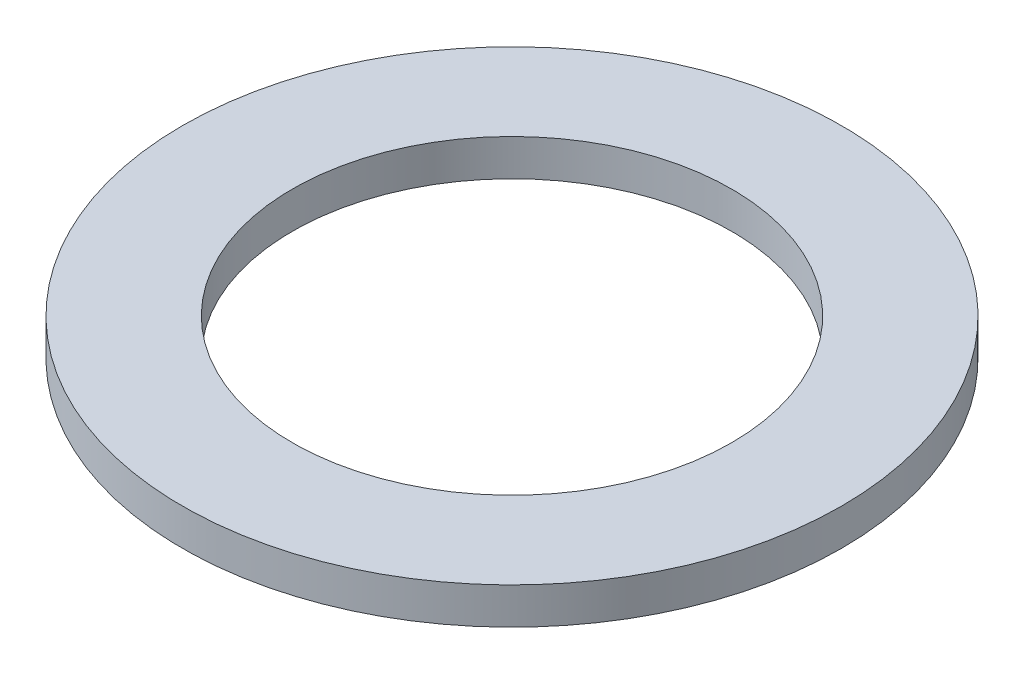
ISO-10303-21;
HEADER;
FILE_DESCRIPTION(('STEP AP214'),'2;1');
FILE_NAME('part.step','',(''),(''),'','','');
FILE_SCHEMA(('AUTOMOTIVE_DESIGN { 1 0 10303 214 1 1 1 1 }'));
ENDSEC;
DATA;
#1=APPLICATION_CONTEXT('core data for automotive mechanical design processes');
#2=APPLICATION_PROTOCOL_DEFINITION('international standard','automotive_design',2000,#1);
#3=PRODUCT_CONTEXT('',#1,'mechanical');
#4=PRODUCT('Part','Part','',(#3));
#5=PRODUCT_RELATED_PRODUCT_CATEGORY('part','',(#4));
#6=PRODUCT_DEFINITION_FORMATION('','',#4);
#7=PRODUCT_DEFINITION_CONTEXT('part definition',#1,'design');
#8=PRODUCT_DEFINITION('design','',#6,#7);
#9=PRODUCT_DEFINITION_SHAPE('','',#8);
#10=(LENGTH_UNIT() NAMED_UNIT(*) SI_UNIT(.MILLI.,.METRE.));
#11=(NAMED_UNIT(*) PLANE_ANGLE_UNIT() SI_UNIT($,.RADIAN.));
#12=(NAMED_UNIT(*) SI_UNIT($,.STERADIAN.) SOLID_ANGLE_UNIT());
#13=UNCERTAINTY_MEASURE_WITH_UNIT(LENGTH_MEASURE(1.E-05),#10,'distance_accuracy_value','');
#14=(GEOMETRIC_REPRESENTATION_CONTEXT(3) GLOBAL_UNCERTAINTY_ASSIGNED_CONTEXT((#13)) GLOBAL_UNIT_ASSIGNED_CONTEXT((#10,
#11,#12)) REPRESENTATION_CONTEXT('',''));
#15=CARTESIAN_POINT('',(0.,0.,0.));
#16=DIRECTION('',(0.,0.,1.));
#17=DIRECTION('',(1.,0.,0.));
#18=AXIS2_PLACEMENT_3D('',#15,#16,#17);
#19=CARTESIAN_POINT('',(0.,1.,0.));
#20=DIRECTION('',(0.,-1.,0.));
#21=DIRECTION('',(1.,0.,0.));
#22=AXIS2_PLACEMENT_3D('',#19,#20,#21);
#23=PLANE('',#22);
#24=CARTESIAN_POINT('',(0.,1.,0.));
#25=DIRECTION('',(0.,-1.,0.));
#26=DIRECTION('',(1.,0.,0.));
#27=AXIS2_PLACEMENT_3D('',#24,#25,#26);
#28=CIRCLE('',#27,9.);
#29=CARTESIAN_POINT('',(9.,1.,0.));
#30=VERTEX_POINT('',#29);
#31=EDGE_CURVE('E26',#30,#30,#28,.T.);
#32=ORIENTED_EDGE('',*,*,#31,.F.);
#33=EDGE_LOOP('',(#32));
#34=FACE_BOUND('',#33,.T.);
#35=CARTESIAN_POINT('',(0.,1.,0.));
#36=DIRECTION('',(0.,-1.,0.));
#37=DIRECTION('',(1.,0.,0.));
#38=AXIS2_PLACEMENT_3D('',#35,#36,#37);
#39=CIRCLE('',#38,6.);
#40=CARTESIAN_POINT('',(6.,1.,0.));
#41=VERTEX_POINT('',#40);
#42=EDGE_CURVE('E17',#41,#41,#39,.T.);
#43=ORIENTED_EDGE('',*,*,#42,.T.);
#44=EDGE_LOOP('',(#43));
#45=FACE_BOUND('',#44,.T.);
#46=ADVANCED_FACE('F14',(#34,#45),#23,.F.);
#47=CARTESIAN_POINT('',(0.,1.05,0.));
#48=DIRECTION('',(0.,-1.,0.));
#49=DIRECTION('',(1.,0.,0.));
#50=AXIS2_PLACEMENT_3D('',#47,#48,#49);
#51=CYLINDRICAL_SURFACE('',#50,6.);
#52=ORIENTED_EDGE('',*,*,#42,.F.);
#53=EDGE_LOOP('',(#52));
#54=FACE_BOUND('',#53,.T.);
#55=CARTESIAN_POINT('',(0.,0.,0.));
#56=DIRECTION('',(0.,-1.,0.));
#57=DIRECTION('',(1.,0.,0.));
#58=AXIS2_PLACEMENT_3D('',#55,#56,#57);
#59=CIRCLE('',#58,6.);
#60=CARTESIAN_POINT('',(6.,0.,0.));
#61=VERTEX_POINT('',#60);
#62=EDGE_CURVE('E21',#61,#61,#59,.F.);
#63=ORIENTED_EDGE('',*,*,#62,.F.);
#64=EDGE_LOOP('',(#63));
#65=FACE_BOUND('',#64,.T.);
#66=ADVANCED_FACE('F35',(#54,#65),#51,.F.);
#67=CARTESIAN_POINT('',(0.,1.05,0.));
#68=DIRECTION('',(0.,-1.,0.));
#69=DIRECTION('',(1.,0.,0.));
#70=AXIS2_PLACEMENT_3D('',#67,#68,#69);
#71=CYLINDRICAL_SURFACE('',#70,9.);
#72=ORIENTED_EDGE('',*,*,#31,.T.);
#73=EDGE_LOOP('',(#72));
#74=FACE_BOUND('',#73,.T.);
#75=CARTESIAN_POINT('',(0.,0.,0.));
#76=DIRECTION('',(0.,-1.,0.));
#77=DIRECTION('',(1.,0.,0.));
#78=AXIS2_PLACEMENT_3D('',#75,#76,#77);
#79=CIRCLE('',#78,9.);
#80=CARTESIAN_POINT('',(9.,0.,0.));
#81=VERTEX_POINT('',#80);
#82=EDGE_CURVE('E10',#81,#81,#79,.T.);
#83=ORIENTED_EDGE('',*,*,#82,.F.);
#84=EDGE_LOOP('',(#83));
#85=FACE_BOUND('',#84,.T.);
#86=ADVANCED_FACE('F38',(#74,#85),#71,.T.);
#87=CARTESIAN_POINT('',(0.,0.,0.));
#88=DIRECTION('',(0.,-1.,0.));
#89=DIRECTION('',(1.,0.,0.));
#90=AXIS2_PLACEMENT_3D('',#87,#88,#89);
#91=PLANE('',#90);
#92=ORIENTED_EDGE('',*,*,#82,.T.);
#93=EDGE_LOOP('',(#92));
#94=FACE_BOUND('',#93,.T.);
#95=ORIENTED_EDGE('',*,*,#62,.T.);
#96=EDGE_LOOP('',(#95));
#97=FACE_BOUND('',#96,.T.);
#98=ADVANCED_FACE('F41',(#94,#97),#91,.T.);
#99=CLOSED_SHELL('',(#46,#66,#86,#98));
#100=MANIFOLD_SOLID_BREP('B1',#99);
#101=ADVANCED_BREP_SHAPE_REPRESENTATION('',(#18,#100),#14);
#102=SHAPE_DEFINITION_REPRESENTATION(#9,#101);
ENDSEC;
END-ISO-10303-21;
